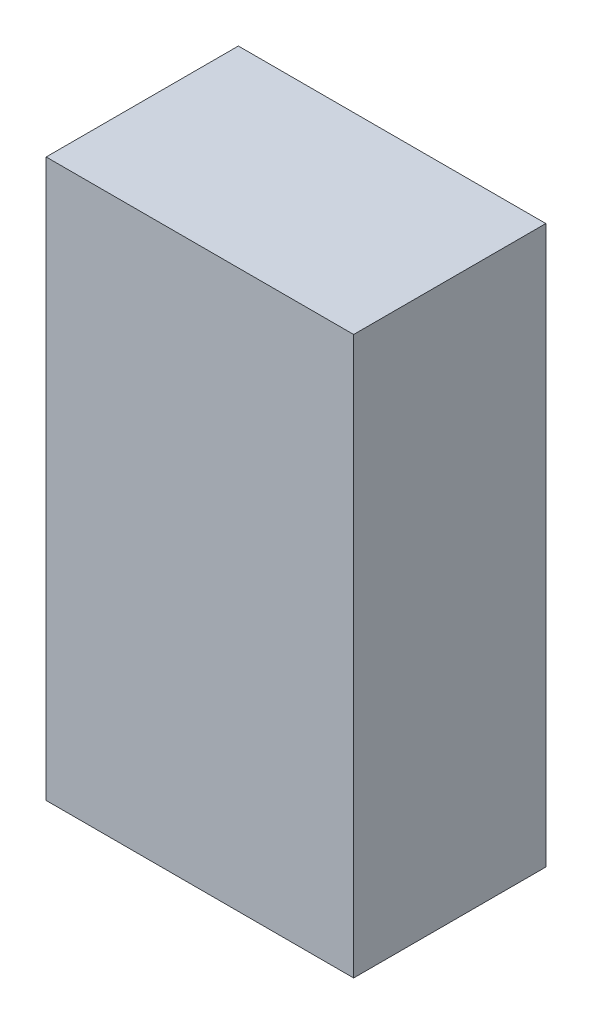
ISO-10303-21;
HEADER;
FILE_DESCRIPTION(('STEP AP214'),'2;1');
FILE_NAME('part.step','',(''),(''),'','','');
FILE_SCHEMA(('AUTOMOTIVE_DESIGN { 1 0 10303 214 1 1 1 1 }'));
ENDSEC;
DATA;
#1=APPLICATION_CONTEXT('core data for automotive mechanical design processes');
#2=APPLICATION_PROTOCOL_DEFINITION('international standard','automotive_design',2000,#1);
#3=PRODUCT_CONTEXT('',#1,'mechanical');
#4=PRODUCT('Part','Part','',(#3));
#5=PRODUCT_RELATED_PRODUCT_CATEGORY('part','',(#4));
#6=PRODUCT_DEFINITION_FORMATION('','',#4);
#7=PRODUCT_DEFINITION_CONTEXT('part definition',#1,'design');
#8=PRODUCT_DEFINITION('design','',#6,#7);
#9=PRODUCT_DEFINITION_SHAPE('','',#8);
#10=(LENGTH_UNIT() NAMED_UNIT(*) SI_UNIT(.MILLI.,.METRE.));
#11=(NAMED_UNIT(*) PLANE_ANGLE_UNIT() SI_UNIT($,.RADIAN.));
#12=(NAMED_UNIT(*) SI_UNIT($,.STERADIAN.) SOLID_ANGLE_UNIT());
#13=UNCERTAINTY_MEASURE_WITH_UNIT(LENGTH_MEASURE(1.E-05),#10,'distance_accuracy_value','');
#14=(GEOMETRIC_REPRESENTATION_CONTEXT(3) GLOBAL_UNCERTAINTY_ASSIGNED_CONTEXT((#13)) GLOBAL_UNIT_ASSIGNED_CONTEXT((#10,
#11,#12)) REPRESENTATION_CONTEXT('',''));
#15=CARTESIAN_POINT('',(0.,0.,0.));
#16=DIRECTION('',(0.,0.,1.));
#17=DIRECTION('',(1.,0.,0.));
#18=AXIS2_PLACEMENT_3D('',#15,#16,#17);
#19=CARTESIAN_POINT('',(0.,0.,1.00000054));
#20=DIRECTION('',(0.,0.,1.));
#21=DIRECTION('',(1.,0.,0.));
#22=AXIS2_PLACEMENT_3D('',#19,#20,#21);
#23=PLANE('',#22);
#24=DIRECTION('',(0.,-1.,0.));
#25=VECTOR('',#24,1.);
#26=CARTESIAN_POINT('',(-0.80000094,1.44999964,1.00000054));
#27=LINE('',#26,#25);
#28=CARTESIAN_POINT('',(-0.80000094,1.44999964,1.00000054));
#29=VERTEX_POINT('',#28);
#30=CARTESIAN_POINT('',(-0.80000094,-1.44999964,1.00000054));
#31=VERTEX_POINT('',#30);
#32=EDGE_CURVE('E81',#29,#31,#27,.T.);
#33=ORIENTED_EDGE('',*,*,#32,.T.);
#34=DIRECTION('',(1.,0.,0.));
#35=VECTOR('',#34,1.);
#36=CARTESIAN_POINT('',(-0.80000094,-1.44999964,1.00000054));
#37=LINE('',#36,#35);
#38=CARTESIAN_POINT('',(0.80000094,-1.44999964,1.00000054));
#39=VERTEX_POINT('',#38);
#40=EDGE_CURVE('E98',#31,#39,#37,.T.);
#41=ORIENTED_EDGE('',*,*,#40,.T.);
#42=DIRECTION('',(0.,1.,0.));
#43=VECTOR('',#42,1.);
#44=CARTESIAN_POINT('',(0.80000094,-1.44999964,1.00000054));
#45=LINE('',#44,#43);
#46=CARTESIAN_POINT('',(0.80000094,1.44999964,1.00000054));
#47=VERTEX_POINT('',#46);
#48=EDGE_CURVE('E74',#39,#47,#45,.T.);
#49=ORIENTED_EDGE('',*,*,#48,.T.);
#50=DIRECTION('',(-1.,0.,0.));
#51=VECTOR('',#50,1.);
#52=CARTESIAN_POINT('',(0.80000094,1.44999964,1.00000054));
#53=LINE('',#52,#51);
#54=EDGE_CURVE('E11',#47,#29,#53,.T.);
#55=ORIENTED_EDGE('',*,*,#54,.T.);
#56=EDGE_LOOP('',(#33,#41,#49,#55));
#57=FACE_BOUND('',#56,.T.);
#58=ADVANCED_FACE('F17',(#57),#23,.T.);
#59=CARTESIAN_POINT('',(0.,0.,0.));
#60=DIRECTION('',(0.,0.,1.));
#61=DIRECTION('',(1.,0.,0.));
#62=AXIS2_PLACEMENT_3D('',#59,#60,#61);
#63=PLANE('',#62);
#64=DIRECTION('',(-1.,0.,0.));
#65=VECTOR('',#64,1.);
#66=CARTESIAN_POINT('',(0.80000094,1.44999964,0.));
#67=LINE('',#66,#65);
#68=CARTESIAN_POINT('',(0.80000094,1.44999964,0.));
#69=VERTEX_POINT('',#68);
#70=CARTESIAN_POINT('',(-0.80000094,1.44999964,0.));
#71=VERTEX_POINT('',#70);
#72=EDGE_CURVE('E20',#69,#71,#67,.T.);
#73=ORIENTED_EDGE('',*,*,#72,.F.);
#74=DIRECTION('',(0.,1.,0.));
#75=VECTOR('',#74,1.);
#76=CARTESIAN_POINT('',(0.80000094,-1.44999964,0.));
#77=LINE('',#76,#75);
#78=CARTESIAN_POINT('',(0.80000094,-1.44999964,0.));
#79=VERTEX_POINT('',#78);
#80=EDGE_CURVE('E107',#79,#69,#77,.T.);
#81=ORIENTED_EDGE('',*,*,#80,.F.);
#82=DIRECTION('',(1.,0.,0.));
#83=VECTOR('',#82,1.);
#84=CARTESIAN_POINT('',(-0.80000094,-1.44999964,0.));
#85=LINE('',#84,#83);
#86=CARTESIAN_POINT('',(-0.80000094,-1.44999964,0.));
#87=VERTEX_POINT('',#86);
#88=EDGE_CURVE('E83',#87,#79,#85,.T.);
#89=ORIENTED_EDGE('',*,*,#88,.F.);
#90=DIRECTION('',(0.,-1.,0.));
#91=VECTOR('',#90,1.);
#92=CARTESIAN_POINT('',(-0.80000094,1.44999964,0.));
#93=LINE('',#92,#91);
#94=EDGE_CURVE('E79',#71,#87,#93,.T.);
#95=ORIENTED_EDGE('',*,*,#94,.F.);
#96=EDGE_LOOP('',(#73,#81,#89,#95));
#97=FACE_BOUND('',#96,.T.);
#98=ADVANCED_FACE('F85',(#97),#63,.F.);
#99=CARTESIAN_POINT('',(0.80000094,1.44999964,0.));
#100=DIRECTION('',(0.,-1.,0.));
#101=DIRECTION('',(0.,0.,-1.));
#102=AXIS2_PLACEMENT_3D('',#99,#100,#101);
#103=PLANE('',#102);
#104=ORIENTED_EDGE('',*,*,#72,.T.);
#105=DIRECTION('',(0.,0.,1.));
#106=VECTOR('',#105,1.);
#107=CARTESIAN_POINT('',(-0.80000094,1.44999964,0.));
#108=LINE('',#107,#106);
#109=EDGE_CURVE('E68',#71,#29,#108,.T.);
#110=ORIENTED_EDGE('',*,*,#109,.T.);
#111=ORIENTED_EDGE('',*,*,#54,.F.);
#112=DIRECTION('',(0.,0.,1.));
#113=VECTOR('',#112,1.);
#114=CARTESIAN_POINT('',(0.80000094,1.44999964,0.));
#115=LINE('',#114,#113);
#116=EDGE_CURVE('E71',#69,#47,#115,.T.);
#117=ORIENTED_EDGE('',*,*,#116,.F.);
#118=EDGE_LOOP('',(#104,#110,#111,#117));
#119=FACE_BOUND('',#118,.T.);
#120=ADVANCED_FACE('F67',(#119),#103,.F.);
#121=CARTESIAN_POINT('',(0.80000094,-1.44999964,0.));
#122=DIRECTION('',(-1.,0.,0.));
#123=DIRECTION('',(0.,0.,1.));
#124=AXIS2_PLACEMENT_3D('',#121,#122,#123);
#125=PLANE('',#124);
#126=ORIENTED_EDGE('',*,*,#80,.T.);
#127=ORIENTED_EDGE('',*,*,#116,.T.);
#128=ORIENTED_EDGE('',*,*,#48,.F.);
#129=DIRECTION('',(0.,0.,1.));
#130=VECTOR('',#129,1.);
#131=CARTESIAN_POINT('',(0.80000094,-1.44999964,0.));
#132=LINE('',#131,#130);
#133=EDGE_CURVE('E99',#79,#39,#132,.T.);
#134=ORIENTED_EDGE('',*,*,#133,.F.);
#135=EDGE_LOOP('',(#126,#127,#128,#134));
#136=FACE_BOUND('',#135,.T.);
#137=ADVANCED_FACE('F119',(#136),#125,.F.);
#138=CARTESIAN_POINT('',(-0.80000094,-1.44999964,0.));
#139=DIRECTION('',(0.,1.,0.));
#140=DIRECTION('',(1.,0.,0.));
#141=AXIS2_PLACEMENT_3D('',#138,#139,#140);
#142=PLANE('',#141);
#143=ORIENTED_EDGE('',*,*,#88,.T.);
#144=ORIENTED_EDGE('',*,*,#133,.T.);
#145=ORIENTED_EDGE('',*,*,#40,.F.);
#146=DIRECTION('',(0.,0.,1.));
#147=VECTOR('',#146,1.);
#148=CARTESIAN_POINT('',(-0.80000094,-1.44999964,0.));
#149=LINE('',#148,#147);
#150=EDGE_CURVE('E89',#87,#31,#149,.T.);
#151=ORIENTED_EDGE('',*,*,#150,.F.);
#152=EDGE_LOOP('',(#143,#144,#145,#151));
#153=FACE_BOUND('',#152,.T.);
#154=ADVANCED_FACE('F121',(#153),#142,.F.);
#155=CARTESIAN_POINT('',(-0.80000094,1.44999964,0.));
#156=DIRECTION('',(1.,0.,0.));
#157=DIRECTION('',(0.,1.,0.));
#158=AXIS2_PLACEMENT_3D('',#155,#156,#157);
#159=PLANE('',#158);
#160=ORIENTED_EDGE('',*,*,#94,.T.);
#161=ORIENTED_EDGE('',*,*,#150,.T.);
#162=ORIENTED_EDGE('',*,*,#32,.F.);
#163=ORIENTED_EDGE('',*,*,#109,.F.);
#164=EDGE_LOOP('',(#160,#161,#162,#163));
#165=FACE_BOUND('',#164,.T.);
#166=ADVANCED_FACE('F77',(#165),#159,.F.);
#167=CLOSED_SHELL('',(#58,#98,#120,#137,#154,#166));
#168=MANIFOLD_SOLID_BREP('B1',#167);
#169=ADVANCED_BREP_SHAPE_REPRESENTATION('',(#18,#168),#14);
#170=SHAPE_DEFINITION_REPRESENTATION(#9,#169);
ENDSEC;
END-ISO-10303-21;
